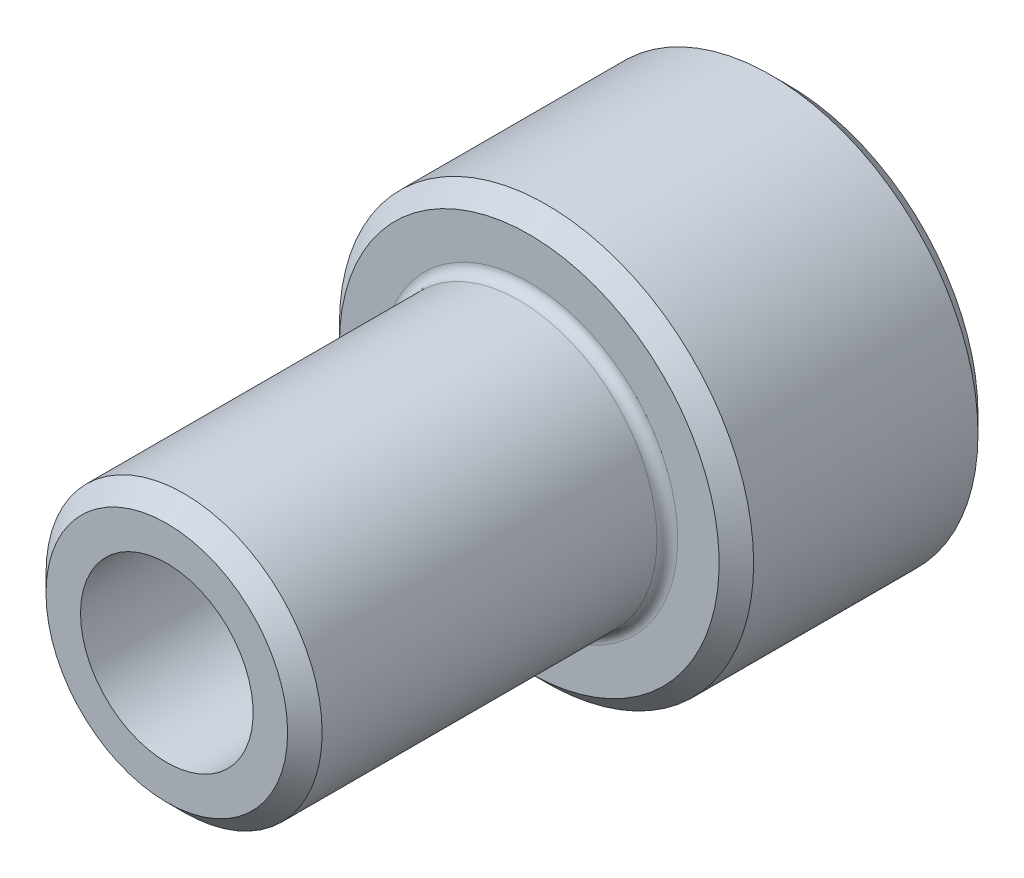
ISO-10303-21;
HEADER;
FILE_DESCRIPTION(('STEP AP214'),'2;1');
FILE_NAME('part.step','',(''),(''),'','','');
FILE_SCHEMA(('AUTOMOTIVE_DESIGN { 1 0 10303 214 1 1 1 1 }'));
ENDSEC;
DATA;
#1=APPLICATION_CONTEXT('core data for automotive mechanical design processes');
#2=APPLICATION_PROTOCOL_DEFINITION('international standard','automotive_design',2000,#1);
#3=PRODUCT_CONTEXT('',#1,'mechanical');
#4=PRODUCT('Part','Part','',(#3));
#5=PRODUCT_RELATED_PRODUCT_CATEGORY('part','',(#4));
#6=PRODUCT_DEFINITION_FORMATION('','',#4);
#7=PRODUCT_DEFINITION_CONTEXT('part definition',#1,'design');
#8=PRODUCT_DEFINITION('design','',#6,#7);
#9=PRODUCT_DEFINITION_SHAPE('','',#8);
#10=(LENGTH_UNIT() NAMED_UNIT(*) SI_UNIT(.MILLI.,.METRE.));
#11=(NAMED_UNIT(*) PLANE_ANGLE_UNIT() SI_UNIT($,.RADIAN.));
#12=(NAMED_UNIT(*) SI_UNIT($,.STERADIAN.) SOLID_ANGLE_UNIT());
#13=UNCERTAINTY_MEASURE_WITH_UNIT(LENGTH_MEASURE(1.E-05),#10,'distance_accuracy_value','');
#14=(GEOMETRIC_REPRESENTATION_CONTEXT(3) GLOBAL_UNCERTAINTY_ASSIGNED_CONTEXT((#13)) GLOBAL_UNIT_ASSIGNED_CONTEXT((#10,
#11,#12)) REPRESENTATION_CONTEXT('',''));
#15=CARTESIAN_POINT('',(0.,0.,0.));
#16=DIRECTION('',(0.,0.,1.));
#17=DIRECTION('',(1.,0.,0.));
#18=AXIS2_PLACEMENT_3D('',#15,#16,#17);
#19=CARTESIAN_POINT('',(0.,0.,0.));
#20=DIRECTION('',(0.,0.,1.));
#21=DIRECTION('',(1.,0.,0.));
#22=AXIS2_PLACEMENT_3D('',#19,#20,#21);
#23=PLANE('',#22);
#24=CARTESIAN_POINT('',(0.,0.,0.));
#25=DIRECTION('',(0.,0.,1.));
#26=DIRECTION('',(1.,0.,0.));
#27=AXIS2_PLACEMENT_3D('',#24,#25,#26);
#28=CIRCLE('',#27,5.5);
#29=CARTESIAN_POINT('',(5.5,0.,0.));
#30=VERTEX_POINT('',#29);
#31=EDGE_CURVE('E27',#30,#30,#28,.F.);
#32=ORIENTED_EDGE('',*,*,#31,.T.);
#33=EDGE_LOOP('',(#32));
#34=FACE_BOUND('',#33,.T.);
#35=CARTESIAN_POINT('',(0.,0.,0.));
#36=DIRECTION('',(0.,0.,-1.));
#37=DIRECTION('',(-1.,0.,0.));
#38=AXIS2_PLACEMENT_3D('',#35,#36,#37);
#39=CIRCLE('',#38,2.5);
#40=CARTESIAN_POINT('',(-2.5,0.,0.));
#41=VERTEX_POINT('',#40);
#42=EDGE_CURVE('E45',#41,#41,#39,.T.);
#43=ORIENTED_EDGE('',*,*,#42,.F.);
#44=EDGE_LOOP('',(#43));
#45=FACE_BOUND('',#44,.T.);
#46=ADVANCED_FACE('F12',(#34,#45),#23,.F.);
#47=CARTESIAN_POINT('',(0.,0.,18.));
#48=DIRECTION('',(0.,0.,1.));
#49=DIRECTION('',(1.,0.,0.));
#50=AXIS2_PLACEMENT_3D('',#47,#48,#49);
#51=CYLINDRICAL_SURFACE('',#50,6.);
#52=CARTESIAN_POINT('',(0.,0.,0.5));
#53=DIRECTION('',(0.,0.,1.));
#54=DIRECTION('',(1.,0.,0.));
#55=AXIS2_PLACEMENT_3D('',#52,#53,#54);
#56=CIRCLE('',#55,6.);
#57=CARTESIAN_POINT('',(6.,0.,0.5));
#58=VERTEX_POINT('',#57);
#59=EDGE_CURVE('E32',#58,#58,#56,.T.);
#60=ORIENTED_EDGE('',*,*,#59,.T.);
#61=EDGE_LOOP('',(#60));
#62=FACE_BOUND('',#61,.T.);
#63=CARTESIAN_POINT('',(0.,0.,7.));
#64=DIRECTION('',(0.,0.,-1.));
#65=DIRECTION('',(-1.,0.,0.));
#66=AXIS2_PLACEMENT_3D('',#63,#64,#65);
#67=CIRCLE('',#66,6.);
#68=CARTESIAN_POINT('',(-6.,0.,7.));
#69=VERTEX_POINT('',#68);
#70=EDGE_CURVE('E35',#69,#69,#67,.T.);
#71=ORIENTED_EDGE('',*,*,#70,.T.);
#72=EDGE_LOOP('',(#71));
#73=FACE_BOUND('',#72,.T.);
#74=ADVANCED_FACE('F61',(#62,#73),#51,.T.);
#75=CARTESIAN_POINT('',(0.,6.,7.5));
#76=DIRECTION('',(0.,0.,-1.));
#77=DIRECTION('',(-1.,0.,0.));
#78=AXIS2_PLACEMENT_3D('',#75,#76,#77);
#79=PLANE('',#78);
#80=CARTESIAN_POINT('',(0.,0.,7.5));
#81=DIRECTION('',(0.,0.,-1.));
#82=DIRECTION('',(-1.,0.,0.));
#83=AXIS2_PLACEMENT_3D('',#80,#81,#82);
#84=CIRCLE('',#83,5.5);
#85=CARTESIAN_POINT('',(-5.5,0.,7.5));
#86=VERTEX_POINT('',#85);
#87=EDGE_CURVE('E23',#86,#86,#84,.F.);
#88=ORIENTED_EDGE('',*,*,#87,.T.);
#89=EDGE_LOOP('',(#88));
#90=FACE_BOUND('',#89,.T.);
#91=CARTESIAN_POINT('',(0.,0.,7.5));
#92=DIRECTION('',(0.,0.,-1.));
#93=DIRECTION('',(-1.,0.,0.));
#94=AXIS2_PLACEMENT_3D('',#91,#92,#93);
#95=CIRCLE('',#94,4.3);
#96=CARTESIAN_POINT('',(-4.3,0.,7.5));
#97=VERTEX_POINT('',#96);
#98=EDGE_CURVE('E38',#97,#97,#95,.T.);
#99=ORIENTED_EDGE('',*,*,#98,.T.);
#100=EDGE_LOOP('',(#99));
#101=FACE_BOUND('',#100,.T.);
#102=ADVANCED_FACE('F69',(#90,#101),#79,.F.);
#103=CARTESIAN_POINT('',(0.,0.,18.));
#104=DIRECTION('',(0.,0.,1.));
#105=DIRECTION('',(1.,0.,0.));
#106=AXIS2_PLACEMENT_3D('',#103,#104,#105);
#107=CYLINDRICAL_SURFACE('',#106,4.);
#108=CARTESIAN_POINT('',(0.,0.,17.5));
#109=DIRECTION('',(0.,0.,-1.));
#110=DIRECTION('',(-1.,0.,0.));
#111=AXIS2_PLACEMENT_3D('',#108,#109,#110);
#112=CIRCLE('',#111,4.);
#113=CARTESIAN_POINT('',(-4.,0.,17.5));
#114=VERTEX_POINT('',#113);
#115=EDGE_CURVE('E8',#114,#114,#112,.T.);
#116=ORIENTED_EDGE('',*,*,#115,.T.);
#117=EDGE_LOOP('',(#116));
#118=FACE_BOUND('',#117,.T.);
#119=CARTESIAN_POINT('',(0.,0.,7.8));
#120=DIRECTION('',(0.,0.,-1.));
#121=DIRECTION('',(-1.,0.,0.));
#122=AXIS2_PLACEMENT_3D('',#119,#120,#121);
#123=CIRCLE('',#122,4.);
#124=CARTESIAN_POINT('',(-4.,0.,7.8));
#125=VERTEX_POINT('',#124);
#126=EDGE_CURVE('E41',#125,#125,#123,.F.);
#127=ORIENTED_EDGE('',*,*,#126,.T.);
#128=EDGE_LOOP('',(#127));
#129=FACE_BOUND('',#128,.T.);
#130=ADVANCED_FACE('F94',(#118,#129),#107,.T.);
#131=CARTESIAN_POINT('',(0.,4.,18.));
#132=DIRECTION('',(0.,0.,-1.));
#133=DIRECTION('',(-1.,0.,0.));
#134=AXIS2_PLACEMENT_3D('',#131,#132,#133);
#135=PLANE('',#134);
#136=CARTESIAN_POINT('',(0.,0.,18.));
#137=DIRECTION('',(0.,0.,-1.));
#138=DIRECTION('',(-1.,0.,0.));
#139=AXIS2_PLACEMENT_3D('',#136,#137,#138);
#140=CIRCLE('',#139,3.5);
#141=CARTESIAN_POINT('',(-3.5,0.,18.));
#142=VERTEX_POINT('',#141);
#143=EDGE_CURVE('E19',#142,#142,#140,.F.);
#144=ORIENTED_EDGE('',*,*,#143,.T.);
#145=EDGE_LOOP('',(#144));
#146=FACE_BOUND('',#145,.T.);
#147=CARTESIAN_POINT('',(0.,0.,18.));
#148=DIRECTION('',(0.,0.,-1.));
#149=DIRECTION('',(-1.,0.,0.));
#150=AXIS2_PLACEMENT_3D('',#147,#148,#149);
#151=CIRCLE('',#150,2.5);
#152=CARTESIAN_POINT('',(-2.5,0.,18.));
#153=VERTEX_POINT('',#152);
#154=EDGE_CURVE('E44',#153,#153,#151,.T.);
#155=ORIENTED_EDGE('',*,*,#154,.T.);
#156=EDGE_LOOP('',(#155));
#157=FACE_BOUND('',#156,.T.);
#158=ADVANCED_FACE('F51',(#146,#157),#135,.F.);
#159=CARTESIAN_POINT('',(0.,0.,18.));
#160=DIRECTION('',(0.,0.,-1.));
#161=DIRECTION('',(-1.,0.,0.));
#162=AXIS2_PLACEMENT_3D('',#159,#160,#161);
#163=CYLINDRICAL_SURFACE('',#162,2.5);
#164=ORIENTED_EDGE('',*,*,#154,.F.);
#165=EDGE_LOOP('',(#164));
#166=FACE_BOUND('',#165,.T.);
#167=ORIENTED_EDGE('',*,*,#42,.T.);
#168=EDGE_LOOP('',(#167));
#169=FACE_BOUND('',#168,.T.);
#170=ADVANCED_FACE('F53',(#166,#169),#163,.F.);
#171=CARTESIAN_POINT('',(0.,0.,7.8));
#172=DIRECTION('',(0.,0.,-1.));
#173=DIRECTION('',(-1.,0.,0.));
#174=AXIS2_PLACEMENT_3D('',#171,#172,#173);
#175=TOROIDAL_SURFACE('',#174,4.3,0.3);
#176=ORIENTED_EDGE('',*,*,#98,.F.);
#177=EDGE_LOOP('',(#176));
#178=FACE_BOUND('',#177,.T.);
#179=ORIENTED_EDGE('',*,*,#126,.F.);
#180=EDGE_LOOP('',(#179));
#181=FACE_BOUND('',#180,.T.);
#182=ADVANCED_FACE('F56',(#178,#181),#175,.F.);
#183=CARTESIAN_POINT('',(0.,0.,0.5));
#184=DIRECTION('',(0.,0.,1.));
#185=DIRECTION('',(1.,0.,0.));
#186=AXIS2_PLACEMENT_3D('',#183,#184,#185);
#187=CONICAL_SURFACE('',#186,6.,0.785398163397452);
#188=ORIENTED_EDGE('',*,*,#31,.F.);
#189=EDGE_LOOP('',(#188));
#190=FACE_BOUND('',#189,.T.);
#191=ORIENTED_EDGE('',*,*,#59,.F.);
#192=EDGE_LOOP('',(#191));
#193=FACE_BOUND('',#192,.T.);
#194=ADVANCED_FACE('F76',(#190,#193),#187,.T.);
#195=CARTESIAN_POINT('',(0.,0.,7.5));
#196=DIRECTION('',(0.,0.,-1.));
#197=DIRECTION('',(-1.,0.,0.));
#198=AXIS2_PLACEMENT_3D('',#195,#196,#197);
#199=CONICAL_SURFACE('',#198,5.5,0.785398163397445);
#200=ORIENTED_EDGE('',*,*,#70,.F.);
#201=EDGE_LOOP('',(#200));
#202=FACE_BOUND('',#201,.T.);
#203=ORIENTED_EDGE('',*,*,#87,.F.);
#204=EDGE_LOOP('',(#203));
#205=FACE_BOUND('',#204,.T.);
#206=ADVANCED_FACE('F79',(#202,#205),#199,.T.);
#207=CARTESIAN_POINT('',(0.,0.,18.));
#208=DIRECTION('',(0.,0.,-1.));
#209=DIRECTION('',(-1.,0.,0.));
#210=AXIS2_PLACEMENT_3D('',#207,#208,#209);
#211=CONICAL_SURFACE('',#210,3.5,0.785398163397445);
#212=ORIENTED_EDGE('',*,*,#115,.F.);
#213=EDGE_LOOP('',(#212));
#214=FACE_BOUND('',#213,.T.);
#215=ORIENTED_EDGE('',*,*,#143,.F.);
#216=EDGE_LOOP('',(#215));
#217=FACE_BOUND('',#216,.T.);
#218=ADVANCED_FACE('F14',(#214,#217),#211,.T.);
#219=CLOSED_SHELL('',(#46,#74,#102,#130,#158,#170,#182,#194,#206,#218));
#220=MANIFOLD_SOLID_BREP('B1',#219);
#221=ADVANCED_BREP_SHAPE_REPRESENTATION('',(#18,#220),#14);
#222=SHAPE_DEFINITION_REPRESENTATION(#9,#221);
ENDSEC;
END-ISO-10303-21;
